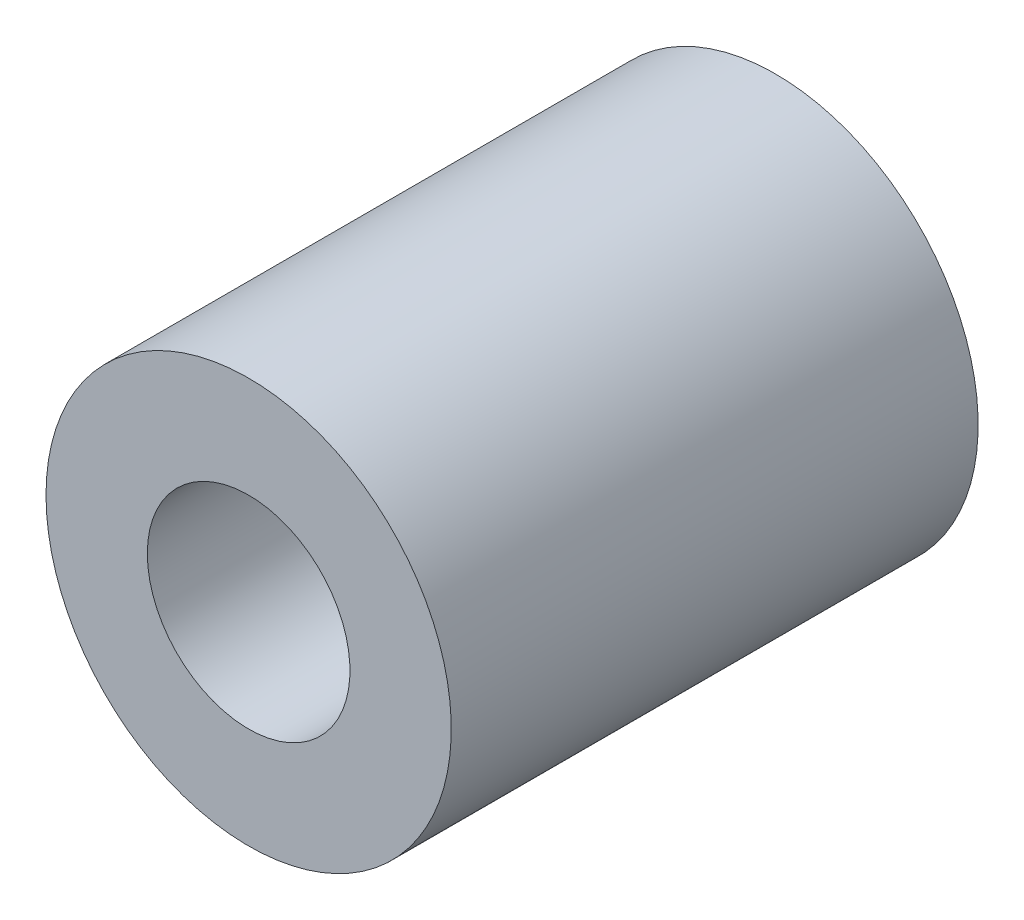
from build123d import *

# Parameters (mm, degrees)
ESQUISSE1_R          = 10
ESQUISSE1_R_2        = 5
BASE_EXTRUSION_DEPTH = 26


with BuildPart() as part:
    # Esquisse1 → Base-Extrusion (new body)
    with BuildSketch(Plane.XY):
        with Locations(Location((0, 0, 0), (0, 0, 180))):
            Circle(ESQUISSE1_R)
        with Locations(Location((0, 0, 0), (0, 0, 180))):
            Circle(ESQUISSE1_R_2, mode=Mode.SUBTRACT)
    extrude(amount=BASE_EXTRUSION_DEPTH)


solid = part.part
